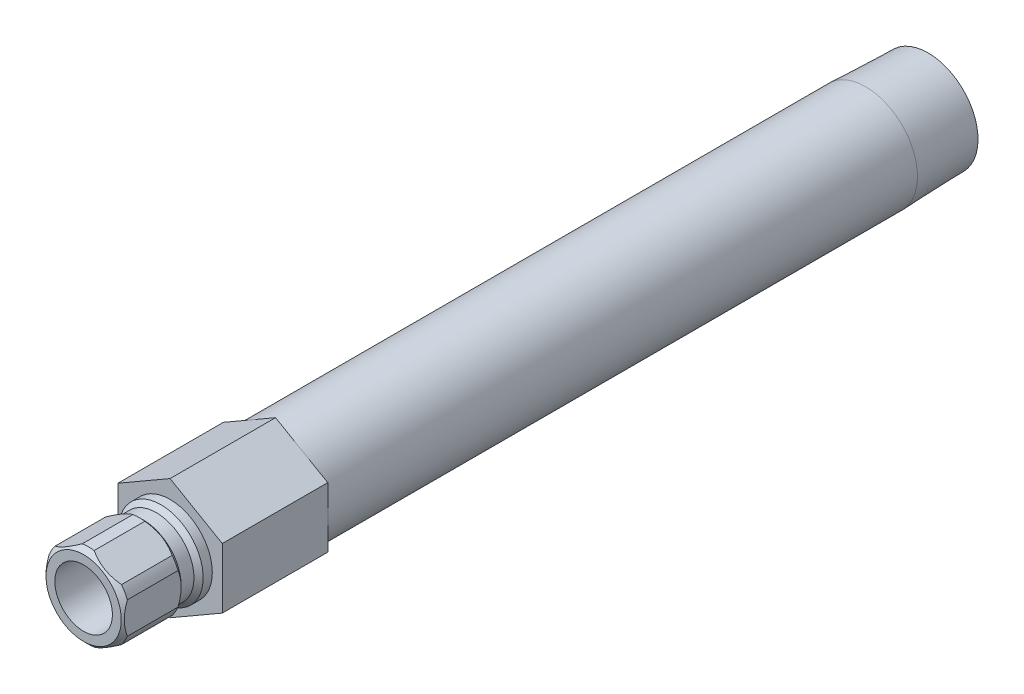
from build123d import *

# Parameters (mm, degrees)
SKETCH2_R           = 4.7625
BOSS_EXTRUDE1_DEPTH = 17.4498
CUT_EXTRUDE1_START  = 4.3942
SKETCH3_OUTSIDE_W   = 47.706
SKETCH3_OUTSIDE_H   = 50.378
CUT_EXTRUDE1_DEPTH  = 122.697556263


with BuildPart() as part:
    # Sketch1 → Revolve1 (revolve)
    with BuildSketch(Plane(origin=(0, 0, 0), x_dir=(0, 0, -1), z_dir=(1, 0, 0))):
        Polygon((-14.3002, 4.7625), (-14.3002, 6.223), (-13.5382, 6.985), (-5.1562, 6.985), (-4.3942, 6.223), (-2.27076, 6.223), (-1.50876, 6.985), (3.175, 6.985), (3.175, 8.5725), (115.062, 8.5725), (125.3998, 8.249445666), (125.3998, 6.2611), (17.4498, 6.2611), (17.4498, 4.7625), align=None)
    revolve(axis=Axis((0, 0, 0), (0, 0, 1)))

    # Sketch2 → Boss-Extrude1 (add)
    with BuildSketch(Plane.XY):
        Polygon((-8.636, 4.985996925), (-8.636, -4.985996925), (0, -9.971993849), (8.636, -4.985996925), (8.636, 4.985996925), (0, 9.971993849), align=None)
        with Locations(Location((0, 0, 0), (0, 0, 90))):
            Circle(SKETCH2_R, mode=Mode.SUBTRACT)
    extrude(amount=-BOSS_EXTRUDE1_DEPTH)

    # Sketch3 outside → Cut-Extrude1 (cut, through all)
    with BuildSketch(Plane.XY.offset(CUT_EXTRUDE1_START)):
        Rectangle(SKETCH3_OUTSIDE_W, SKETCH3_OUTSIDE_H)
        Polygon((6.477, -3.739497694), (6.477, 3.739497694), (0, 7.478995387), (-6.477, 3.739497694), (-6.477, -3.739497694), (0, -7.478995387), align=None, mode=Mode.SUBTRACT)
    extrude(amount=CUT_EXTRUDE1_DEPTH, mode=Mode.SUBTRACT)


solid = part.part
